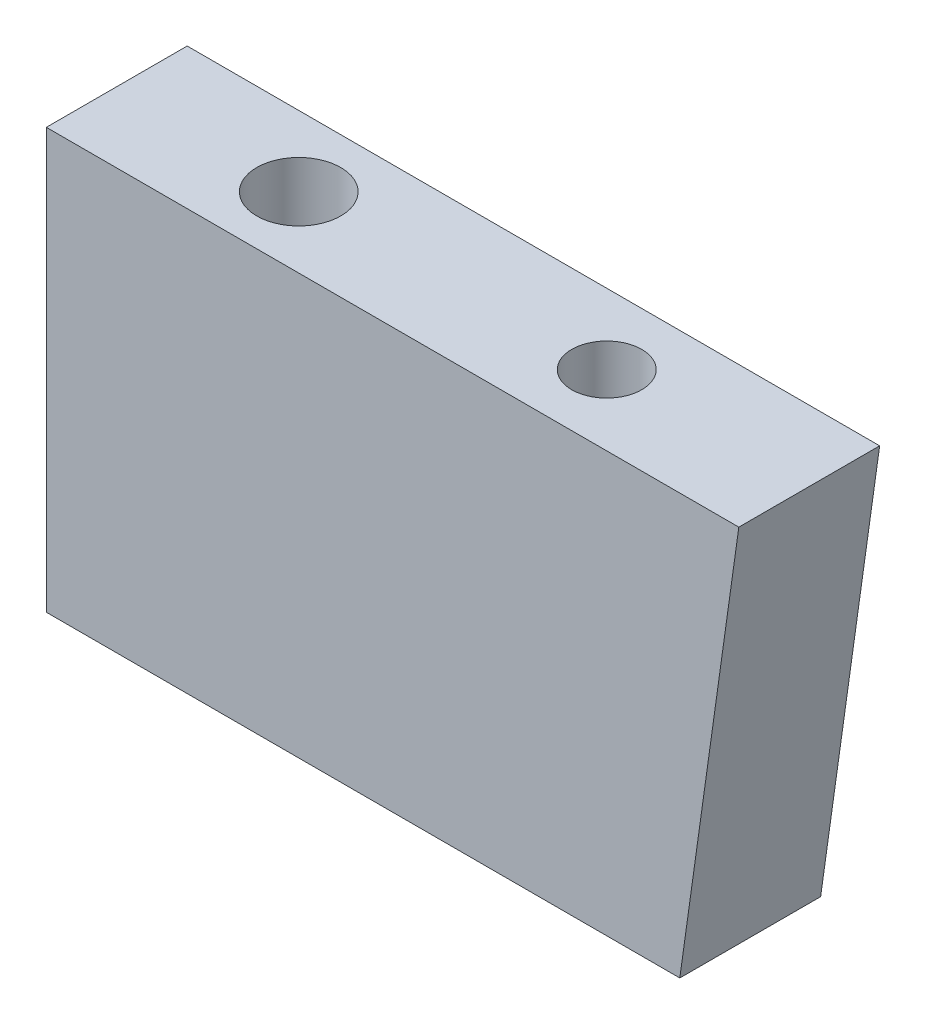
from build123d import *

# Parameters (mm, degrees)
EXTRUDE1_DEPTH                 = 2.515
M3X0_5_TAPPED_HOLE2_AT_2_COUNT = 2
M3X0_5_TAPPED_HOLE2_AT_2_PITCH = 37
M3X0_5_TAPPED_HOLE2_AT_3_COUNT = 2
M3X0_5_TAPPED_HOLE2_AT_3_PITCH = 74
M3X0_5_TAPPED_HOLE2_AT_4_COUNT = 2
M3X0_5_TAPPED_HOLE2_AT_4_PITCH = 111
M3X0_5_TAPPED_HOLE2_AT_5_COUNT = 2
M3X0_5_TAPPED_HOLE2_AT_5_PITCH = 148
CUT_EXTRUDE1_DEPTH             = 214.525878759
M3X0_5_TAPPED_HOLE1_D          = 3
M3X0_5_TAPPED_HOLE1_DEPTH      = 7.5
M3X0_5_TAPPED_HOLE1_TIP        = 0.901290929
F_2_5_2_5_DIAMETER_HOLE1_D     = 2.5
F_2_5_2_5_DIAMETER_HOLE1_DEPTH = 6
F_2_5_2_5_DIAMETER_HOLE1_TIP   = 0.751075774


with BuildPart() as part:
    # Sketch1 → Extrude1 (new, symmetric)
    with BuildSketch(Plane.XY):
        with BuildLine():
            Line((29.232493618, 208), (4.5, 208))
            Line((4.5, 208), (4.5, 37.873672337))
            ThreePointArc((4.5, 37.873672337), (38.14007153, 0), (4.5, -37.873672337))
            Line((4.5, -37.873672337), (4.5, -208))
            Line((4.5, -208), (29.232493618, -208))
            Line((29.232493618, -208), (12, -85.384436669))
            Line((12, -85.384436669), (12, -60))
            ThreePointArc((12, -60), (14.850141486, -49.710084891), (22.588235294, -42.352941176))
            ThreePointArc((22.588235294, -42.352941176), (48, 0), (22.588235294, 42.352941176))
            ThreePointArc((22.588235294, 42.352941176), (14.850141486, 49.710084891), (12, 60))
            Line((12, 60), (12, 85.384436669))
            Line((12, 85.384436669), (29.232493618, 208))
        make_face()
    extrude(amount=EXTRUDE1_DEPTH, both=True)

    # Sketch32 → M3x0.5 Tapped Hole2 (revolve, cut)
    with BuildSketch(Plane(origin=(4.5, 198, 0), x_dir=(0, 0, 1), z_dir=(0, 1, 0))):
        Polygon((0, 0), (0, 8.401290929), (1.5, 7.5), (1.5, 0), align=None)
    m3x0_5_tapped_hole2 = revolve(axis=Axis((-1.85, 198, 0), (1, 0, 0)), mode=Mode.SUBTRACT)

    # M3x0.5 Tapped Hole2 at 2: M3x0.5 Tapped Hole2 ×2
    with Locations(*[(0, -i * M3X0_5_TAPPED_HOLE2_AT_2_PITCH, 0) for i in range(1, M3X0_5_TAPPED_HOLE2_AT_2_COUNT)]):
        add(m3x0_5_tapped_hole2, mode=Mode.SUBTRACT)

    # M3x0.5 Tapped Hole2 at 3: M3x0.5 Tapped Hole2 ×2
    with Locations(*[(0, -i * M3X0_5_TAPPED_HOLE2_AT_3_PITCH, 0) for i in range(1, M3X0_5_TAPPED_HOLE2_AT_3_COUNT)]):
        add(m3x0_5_tapped_hole2, mode=Mode.SUBTRACT)

    # M3x0.5 Tapped Hole2 at 4: M3x0.5 Tapped Hole2 ×2
    with Locations(*[(0, -i * M3X0_5_TAPPED_HOLE2_AT_4_PITCH, 0) for i in range(1, M3X0_5_TAPPED_HOLE2_AT_4_COUNT)]):
        add(m3x0_5_tapped_hole2, mode=Mode.SUBTRACT)

    # M3x0.5 Tapped Hole2 at 5: M3x0.5 Tapped Hole2 ×2
    with Locations(*[(0, -i * M3X0_5_TAPPED_HOLE2_AT_5_PITCH, 0) for i in range(1, M3X0_5_TAPPED_HOLE2_AT_5_COUNT)]):
        add(m3x0_5_tapped_hole2, mode=Mode.SUBTRACT)

    # Mirror2: M3x0.5 Tapped Hole2 across plane
    add(m3x0_5_tapped_hole2.mirror(Plane.ZX), mode=Mode.SUBTRACT)

    # Mirror2 copy 1 sketch → Mirror2 copy 1 (revolve, cut)
    with BuildSketch(Plane(origin=(4.5, -161, 0), x_dir=(0, 0, 1), z_dir=(0, -1, 0))):
        Polygon((0, 0), (0, -8.401290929), (1.5, -7.5), (1.5, 0), align=None)
    revolve(axis=Axis((-1.85, -161, 0), (-1, 0, 0)), mode=Mode.SUBTRACT)

    # Mirror2 copy 2 sketch → Mirror2 copy 2 (revolve, cut)
    with BuildSketch(Plane(origin=(4.5, -124, 0), x_dir=(0, 0, 1), z_dir=(0, -1, 0))):
        Polygon((0, 0), (0, -8.401290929), (1.5, -7.5), (1.5, 0), align=None)
    revolve(axis=Axis((-1.85, -124, 0), (-1, 0, 0)), mode=Mode.SUBTRACT)

    # Mirror2 copy 3 sketch → Mirror2 copy 3 (revolve, cut)
    with BuildSketch(Plane(origin=(4.5, -87, 0), x_dir=(0, 0, 1), z_dir=(0, -1, 0))):
        Polygon((0, 0), (0, -8.401290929), (1.5, -7.5), (1.5, 0), align=None)
    revolve(axis=Axis((-1.85, -87, 0), (-1, 0, 0)), mode=Mode.SUBTRACT)

    # Mirror2 copy 4 sketch → Mirror2 copy 4 (revolve, cut)
    with BuildSketch(Plane(origin=(4.5, -50, 0), x_dir=(0, 0, 1), z_dir=(0, -1, 0))):
        Polygon((0, 0), (0, -8.401290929), (1.5, -7.5), (1.5, 0), align=None)
    revolve(axis=Axis((-1.85, -50, 0), (-1, 0, 0)), mode=Mode.SUBTRACT)

    # Sketch36 → Cut-Extrude1 (cut, through all)
    with BuildSketch(Plane.XY.offset(2.515)):
        with BuildLine():
            Line((4.5, 193), (27.124381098, 193))
            Line((27.124381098, 193), (12, 85.384436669))
            Line((12, 85.384436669), (12, 60))
            ThreePointArc((12, 60), (14.850141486, 49.710084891), (22.588235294, 42.352941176))
            ThreePointArc((22.588235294, 42.352941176), (48, 0), (22.588235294, -42.352941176))
            ThreePointArc((22.588235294, -42.352941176), (14.850141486, -49.710084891), (12, -60))
            Line((12, -60), (12, -85.384436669))
            Line((12, -85.384436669), (29.232493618, -208))
            Line((29.232493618, -208), (4.5, -208))
            Line((4.5, -208), (4.5, -37.873672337))
            ThreePointArc((4.5, -37.873672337), (38.14007153, 0), (4.5, 37.873672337))
            Line((4.5, 37.873672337), (4.5, 193))
        make_face()
    extrude(amount=-CUT_EXTRUDE1_DEPTH, mode=Mode.SUBTRACT)

    # M3x0.5 Tapped Hole1
    with Locations(Plane(origin=(0, 208, 0), x_dir=(-1, 0, 0), z_dir=(0, 1, 0))):
        with Locations((-11, 0)):
            Hole(M3X0_5_TAPPED_HOLE1_D / 2, depth=M3X0_5_TAPPED_HOLE1_DEPTH)
            with Locations((0, 0, -(M3X0_5_TAPPED_HOLE1_DEPTH + M3X0_5_TAPPED_HOLE1_TIP / 2))):  # 118° drill point
                Cone(0, M3X0_5_TAPPED_HOLE1_D / 2, M3X0_5_TAPPED_HOLE1_TIP, mode=Mode.SUBTRACT)

    # 2.5 _2.5_ Diameter Hole1
    with Locations(Plane(origin=(0, 208, 0), x_dir=(-1, 0, 0), z_dir=(0, 1, 0))):
        with Locations((-22, 0)):
            Hole(F_2_5_2_5_DIAMETER_HOLE1_D / 2, depth=F_2_5_2_5_DIAMETER_HOLE1_DEPTH)
            with Locations((0, 0, -(F_2_5_2_5_DIAMETER_HOLE1_DEPTH + F_2_5_2_5_DIAMETER_HOLE1_TIP / 2))):  # 118° drill point
                Cone(0, F_2_5_2_5_DIAMETER_HOLE1_D / 2, F_2_5_2_5_DIAMETER_HOLE1_TIP, mode=Mode.SUBTRACT)


solid = part.part
